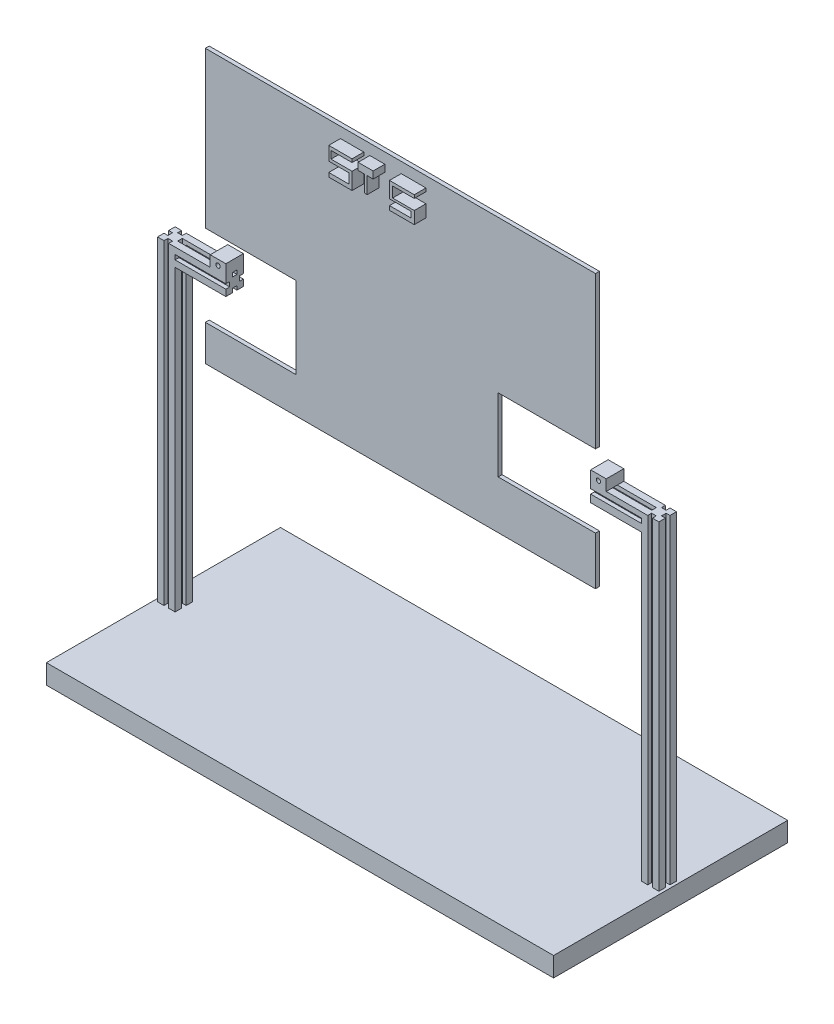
from build123d import *

# Parameters (mm, degrees)
SCHIZZO1_W                   = 1300
SCHIZZO1_H                   = 600
ESTRUSIONE_ESTRUSIONE1_DEPTH = 50
ESTRUSIONE_ESTRUSIONE2_DEPTH = 810
ESTRUSIONE_ESTRUSIONE3_DEPTH = 820
ESTRUSIONE_ESTRUSIONE4_DEPTH = 130
SCHIZZO4_W                   = 6
SCHIZZO4_H                   = 25
ESTRUSIONE_ESTRUSIONE5_DEPTH = 130
SCHIZZO5_W                   = 40
SCHIZZO5_H                   = 45
ESTRUSIONE_ESTRUSIONE6_DEPTH = 28
SCHIZZO6_R                   = 5.5
TAGLIO_ESTRUSIONE1_DEPTH     = 45
SCHIZZO7_W                   = 40
SCHIZZO7_H                   = 45
ESTRUSIONE_ESTRUSIONE7_DEPTH = 28
SCHIZZO8_R                   = 5.5
TAGLIO_ESTRUSIONE2_DEPTH     = 45
ESTRUSIONE_ESTRUSIONE8_DEPTH = 10
ESTRUSIONE_ESTRUSIONE9_DEPTH = 30


with BuildPart() as part:
    # Schizzo1 → Estrusione-Estrusione1 (new body)
    with BuildSketch(Plane(origin=(0, 0, 0), x_dir=(1, 0, 0), z_dir=(0, 1, 0))):
        Rectangle(SCHIZZO1_W, SCHIZZO1_H)
    extrude(amount=ESTRUSIONE_ESTRUSIONE1_DEPTH)

    # Schizzo2 → Estrusione-Estrusione2 (add)
    with BuildSketch(Plane(origin=(0, 50, 0), x_dir=(1, 0, 0), z_dir=(0, 1, 0))):
        Polygon((-626, 22.5), (-642.5, 22.5), (-642.5, 6), (-632.5, 6), (-632.5, -6), (-642.5, -6), (-642.5, -22.5), (-626, -22.5), (-626, -12.5), (-614, -12.5), (-614, -22.5), (-597.5, -22.5), (-597.5, -6), (-607.5, -6), (-607.5, 6), (-597.5, 6), (-597.5, 22.5), (-614, 22.5), (-614, 12.5), (-626, 12.5), align=None)
    extrude(amount=ESTRUSIONE_ESTRUSIONE2_DEPTH)

    # Schizzo2_3 → Estrusione-Estrusione3 (add)
    with BuildSketch(Plane(origin=(0, 50, 0), x_dir=(1, 0, 0), z_dir=(0, 1, 0))):
        Polygon((614, 22.5), (597.5, 22.5), (597.5, 6), (607.5, 6), (607.5, -6), (597.5, -6), (597.5, -22.5), (614, -22.5), (614, -12.5), (626, -12.5), (626, -22.5), (642.5, -22.5), (642.5, -6), (632.5, -6), (632.5, 6), (642.5, 6), (642.5, 22.5), (626, 22.5), (626, 12.5), (614, 12.5), align=None)
    extrude(amount=ESTRUSIONE_ESTRUSIONE3_DEPTH)

    # Schizzo3 → Estrusione-Estrusione4 (add)
    with BuildSketch(Plane.ZY.offset(-597.5)):
        Polygon((-6, 870), (-22.5, 870), (-22.5, 856.165156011), (-12.5, 856.165156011), (-12.5, 847.5), (-6, 847.5), (-6, 860), align=None)
        Polygon((-6, 835), (-6, 847.5), (-12.5, 847.5), (-12.5, 844.165156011), (-22.5, 844.165156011), (-22.5, 825), (-6, 825), align=None)
        Polygon((22.5, 870), (6, 870), (6, 860), (-6, 860), (-6, 847.5), (12.5, 847.5), (12.5, 856.165156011), (22.5, 856.165156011), align=None)
        Polygon((12.5, 847.5), (-6, 847.5), (-6, 835), (6, 835), (6, 825), (22.5, 825), (22.5, 844.165156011), (12.5, 844.165156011), align=None)
    extrude(amount=ESTRUSIONE_ESTRUSIONE4_DEPTH)

    # Schizzo4 → Estrusione-Estrusione5 (add)
    with BuildSketch(Plane(origin=(-597.5, 0, 0), x_dir=(0, 0, -1), z_dir=(1, 0, 0))):
        Polygon((22.5, 843.5), (22.5, 860), (6, 860), (6, 850), (0, 850), (0, 825), (6, 825), (6, 815), (22.5, 815), (22.5, 831.5), (12.5, 831.5), (12.5, 843.5), align=None)
        with Locations((-3, 837.5)):
            Rectangle(SCHIZZO4_W, SCHIZZO4_H)
        Polygon((-6, 850), (-6, 860), (-22.5, 860), (-22.5, 843.5), (-12.5, 843.5), (-12.5, 831.5), (-22.5, 831.5), (-22.5, 815), (-6, 815), (-6, 825), align=None)
    extrude(amount=ESTRUSIONE_ESTRUSIONE5_DEPTH)

    # Schizzo5 → Estrusione-Estrusione6 (add)
    with BuildSketch(Plane(origin=(0, 860, 0), x_dir=(1, 0, 0), z_dir=(0, 1, 0))):
        with Locations((-487.5, 0)):
            Rectangle(SCHIZZO5_W, SCHIZZO5_H)
    extrude(amount=ESTRUSIONE_ESTRUSIONE6_DEPTH)

    # Schizzo6 → Taglio-Estrusione1 (cut)
    with BuildSketch(Plane.XY.offset(22.5)):
        with Locations((-487.5, 874)):
            Circle(SCHIZZO6_R)
    extrude(amount=-TAGLIO_ESTRUSIONE1_DEPTH, mode=Mode.SUBTRACT)

    # Schizzo7 → Estrusione-Estrusione7 (add)
    with BuildSketch(Plane(origin=(0, 870, 0), x_dir=(1, 0, 0), z_dir=(0, 1, 0))):
        with Locations((487.5, 0)):
            Rectangle(SCHIZZO7_W, SCHIZZO7_H)
    extrude(amount=ESTRUSIONE_ESTRUSIONE7_DEPTH)

    # Schizzo8 → Taglio-Estrusione2 (cut)
    with BuildSketch(Plane.XY.offset(22.5)):
        with Locations((487.5, 884)):
            Circle(SCHIZZO8_R)
    extrude(amount=-TAGLIO_ESTRUSIONE2_DEPTH, mode=Mode.SUBTRACT)


with BuildPart() as body_2:
    # Schizzo9 → Estrusione-Estrusione8 (new body)
    with BuildSketch(Plane.XY.offset(22.5)):
        Polygon((-510.093427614, 950.833506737), (-277.197905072, 950.833506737), (-277.197905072, 741.751681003), (-510.093427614, 741.751681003), (-510.093427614, 650), (489.906572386, 650), (489.906572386, 773.774145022), (240.498596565, 773.774145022), (240.498596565, 960.571851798), (489.906572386, 960.571851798), (489.906572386, 1350), (-510.093427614, 1350), align=None)
    extrude(amount=ESTRUSIONE_ESTRUSIONE8_DEPTH)

    # Schizzo11 → Estrusione-Estrusione9 (add)
    with BuildSketch(Plane.XY.offset(32.5)):
        Polygon((-111.82891439, 1314.344359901), (-157.86603001, 1314.344359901), (-157.86603001, 1295.059928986), (-103.907124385, 1295.059928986), (-103.907124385, 1252.189459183), (-163.686680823, 1252.189459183), (-163.686680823, 1262.486593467), (-111.82891439, 1262.486593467), (-111.82891439, 1287.579061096), (-163.686680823, 1287.579061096), (-163.686680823, 1314.344359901), (-163.686680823, 1322.687565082), (-103.907124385, 1322.687565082), (-103.907124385, 1314.344359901), align=None)
        Polygon((-88.409277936, 1322.687565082), (-88.409277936, 1304.702144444), (-71.680966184, 1304.702144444), (-71.680966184, 1262.486593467), (-65.148430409, 1262.486593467), (-65.148430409, 1304.702144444), (-49.934160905, 1304.702144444), (-49.934160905, 1322.687565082), align=None)
        Polygon((-8.050394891, 1266.740846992), (-8.050394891, 1256.240058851), (55.454203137, 1256.240058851), (55.454203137, 1262.486593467), (55.454203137, 1287.579061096), (0, 1287.579061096), (0, 1314.344359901), (55.454203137, 1314.344359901), (55.454203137, 1322.687565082), (-8.050394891, 1322.687565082), (-8.050394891, 1281.835729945), (47.07874285, 1281.835729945), (47.07874285, 1266.740846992), align=None)
    extrude(amount=ESTRUSIONE_ESTRUSIONE9_DEPTH)


solid = Compound([part.part, body_2.part])
